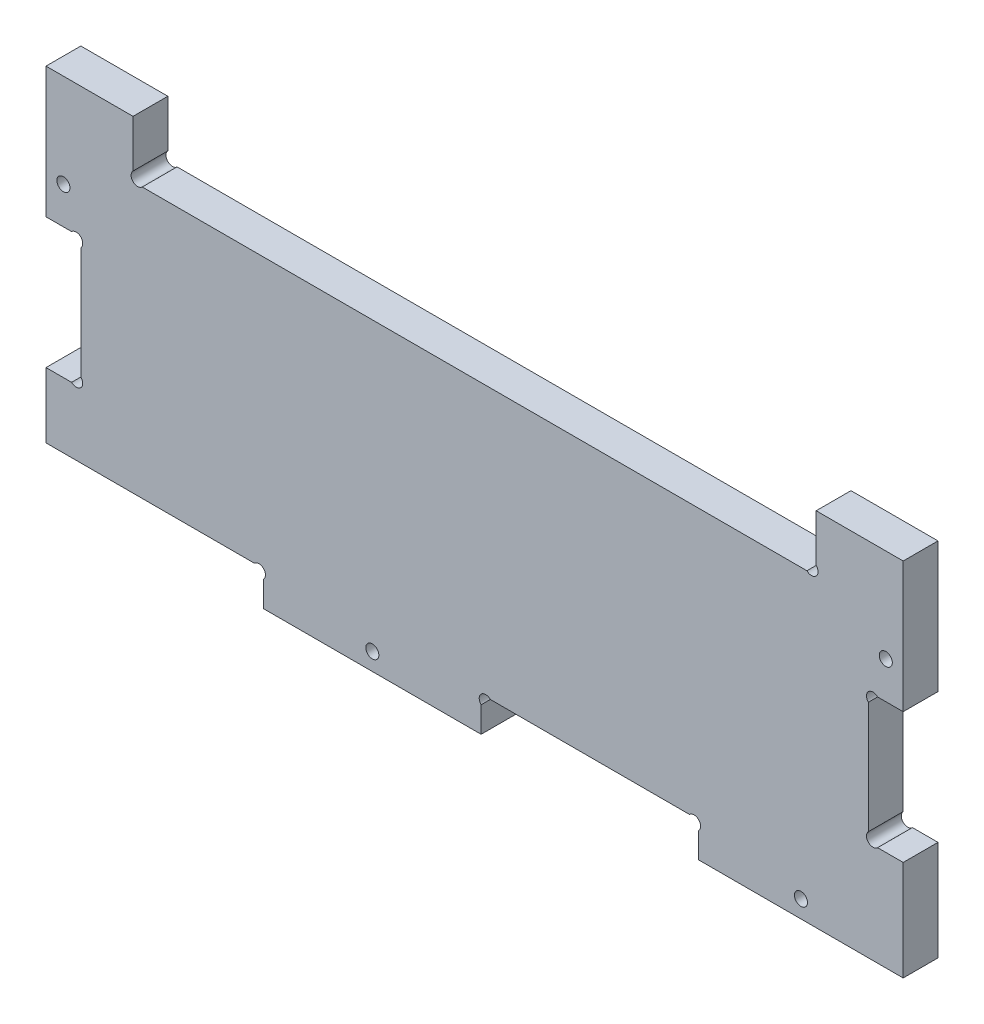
from build123d import *

# Parameters (mm, degrees)
ESQUISSE1_R        = 1.499999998
ESQUISSE1_R_2      = 1.49999999
ESQUISSE1_R_3      = 1.499999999
ESQUISSE1_R_4      = 1.5
BOSS_EXTRU_1_DEPTH = 8


with BuildPart() as part:
    # Esquisse1 → Boss.-Extru.1 (new body)
    with BuildSketch(Plane.XY):
        with BuildLine():
            Line((-173.815675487, 28.383111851), (-173.815675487, 45.383111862))
            Line((-173.815675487, 45.383111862), (-173.815675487, 58.383111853))
            Line((-173.815675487, 58.383111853), (-153.815675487, 58.383111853))
            Line((-153.815675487, 58.383111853), (-153.815675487, 47.504432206))
            ThreePointArc((-153.815675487, 47.504432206), (-153.815675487, 45.383111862), (-151.694355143, 45.383111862))
            Line((-151.694355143, 45.383111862), (1.06300417, 45.383111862))
            ThreePointArc((1.06300417, 45.383111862), (3.184324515, 45.383111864), (3.184324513, 47.504432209))
            Line((3.184324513, 47.504432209), (3.184324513, 58.383111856))
            Line((3.184324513, 58.383111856), (23.184324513, 58.383111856))
            Line((23.184324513, 58.383111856), (23.184324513, 45.383111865))
            Line((23.184324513, 45.383111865), (23.184324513, 28.383111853))
            Line((23.184324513, 28.383111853), (17.305644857, 28.383111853))
            ThreePointArc((17.305644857, 28.383111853), (15.184324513, 28.383111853), (15.184324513, 26.261791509))
            Line((15.184324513, 26.261791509), (15.184324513, 0.504432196))
            ThreePointArc((15.184324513, 0.504432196), (15.184324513, -1.616888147), (17.305644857, -1.616888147))
            Line((17.305644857, -1.616888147), (23.184324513, -1.616888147))
            Line((23.184324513, -1.616888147), (23.184324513, -24.616888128))
            Line((23.184324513, -24.616888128), (-23.815675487, -24.616888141))
            Line((-23.815675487, -24.616888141), (-23.815675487, -18.738208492))
            ThreePointArc((-23.815675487, -18.738208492), (-23.815675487, -16.616888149), (-25.93699583, -16.616888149))
            Line((-25.93699583, -16.616888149), (-71.694355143, -16.616888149))
            ThreePointArc((-71.694355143, -16.616888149), (-73.815675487, -16.616888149), (-73.815675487, -18.738208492))
            Line((-73.815675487, -18.738208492), (-73.815675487, -24.616888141))
            Line((-73.815675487, -24.616888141), (-123.815675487, -24.616888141))
            Line((-123.815675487, -24.616888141), (-123.815675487, -18.738208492))
            ThreePointArc((-123.815675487, -18.738208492), (-123.815675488, -16.616888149), (-125.93699583, -16.61688815))
            Line((-125.93699583, -16.61688815), (-173.815675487, -16.61688815))
            Line((-173.815675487, -16.61688815), (-173.815675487, -1.616888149))
            Line((-173.815675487, -1.616888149), (-167.936995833, -1.616888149))
            ThreePointArc((-167.936995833, -1.616888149), (-165.815675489, -1.616888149), (-165.815675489, 0.504432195))
            Line((-165.815675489, 0.504432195), (-165.815675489, 26.261791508))
            ThreePointArc((-165.815675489, 26.261791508), (-165.815675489, 28.383111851), (-167.936995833, 28.383111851))
            Line((-167.936995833, 28.383111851), (-173.815675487, 28.383111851))
        make_face()
        with Locations((-98.815675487, -20.616888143)):
            Circle(ESQUISSE1_R, mode=Mode.SUBTRACT)
        with Locations((-0.315675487, -20.616888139)):
            Circle(ESQUISSE1_R_2, mode=Mode.SUBTRACT)
        with Locations((19.184324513, 36.883111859)):
            Circle(ESQUISSE1_R_3, mode=Mode.SUBTRACT)
        with Locations((-169.815675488, 36.883111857)):
            Circle(ESQUISSE1_R_4, mode=Mode.SUBTRACT)
    extrude(amount=BOSS_EXTRU_1_DEPTH)


solid = part.part
